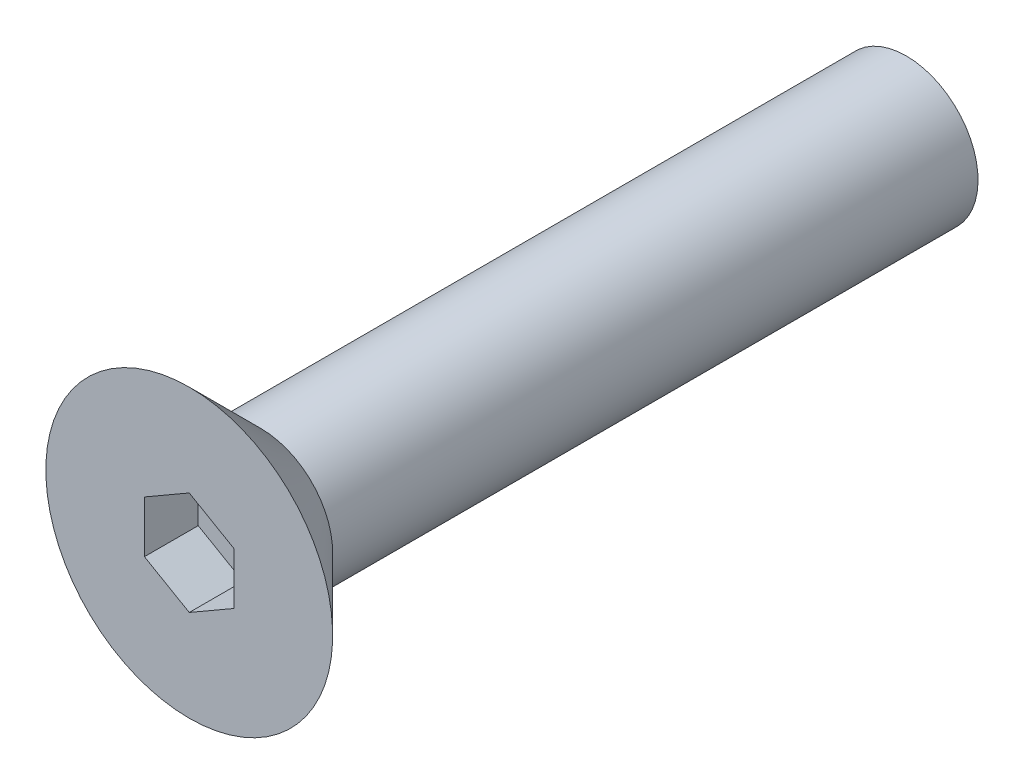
ISO-10303-21;
HEADER;
FILE_DESCRIPTION(('STEP AP214'),'2;1');
FILE_NAME('part.step','',(''),(''),'','','');
FILE_SCHEMA(('AUTOMOTIVE_DESIGN { 1 0 10303 214 1 1 1 1 }'));
ENDSEC;
DATA;
#1=APPLICATION_CONTEXT('core data for automotive mechanical design processes');
#2=APPLICATION_PROTOCOL_DEFINITION('international standard','automotive_design',2000,#1);
#3=PRODUCT_CONTEXT('',#1,'mechanical');
#4=PRODUCT('Part','Part','',(#3));
#5=PRODUCT_RELATED_PRODUCT_CATEGORY('part','',(#4));
#6=PRODUCT_DEFINITION_FORMATION('','',#4);
#7=PRODUCT_DEFINITION_CONTEXT('part definition',#1,'design');
#8=PRODUCT_DEFINITION('design','',#6,#7);
#9=PRODUCT_DEFINITION_SHAPE('','',#8);
#10=(LENGTH_UNIT() NAMED_UNIT(*) SI_UNIT(.MILLI.,.METRE.));
#11=(NAMED_UNIT(*) PLANE_ANGLE_UNIT() SI_UNIT($,.RADIAN.));
#12=(NAMED_UNIT(*) SI_UNIT($,.STERADIAN.) SOLID_ANGLE_UNIT());
#13=UNCERTAINTY_MEASURE_WITH_UNIT(LENGTH_MEASURE(1.E-05),#10,'distance_accuracy_value','');
#14=(GEOMETRIC_REPRESENTATION_CONTEXT(3) GLOBAL_UNCERTAINTY_ASSIGNED_CONTEXT((#13)) GLOBAL_UNIT_ASSIGNED_CONTEXT((#10,
#11,#12)) REPRESENTATION_CONTEXT('',''));
#15=CARTESIAN_POINT('',(0.,0.,0.));
#16=DIRECTION('',(0.,0.,1.));
#17=DIRECTION('',(1.,0.,0.));
#18=AXIS2_PLACEMENT_3D('',#15,#16,#17);
#19=CARTESIAN_POINT('',(0.,0.,0.));
#20=DIRECTION('',(0.,0.,-1.));
#21=DIRECTION('',(0.,1.,0.));
#22=AXIS2_PLACEMENT_3D('',#19,#20,#21);
#23=PLANE('',#22);
#24=DIRECTION('',(-0.866025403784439,-0.5,0.));
#25=VECTOR('',#24,1.);
#26=CARTESIAN_POINT('',(0.,2.88675134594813,0.));
#27=LINE('',#26,#25);
#28=CARTESIAN_POINT('',(0.,2.88675134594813,0.));
#29=VERTEX_POINT('',#28);
#30=CARTESIAN_POINT('',(-2.5,1.44337567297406,0.));
#31=VERTEX_POINT('',#30);
#32=EDGE_CURVE('E102',#29,#31,#27,.T.);
#33=ORIENTED_EDGE('',*,*,#32,.F.);
#34=DIRECTION('',(-0.866025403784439,0.5,0.));
#35=VECTOR('',#34,1.);
#36=CARTESIAN_POINT('',(2.5,1.44337567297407,0.));
#37=LINE('',#36,#35);
#38=CARTESIAN_POINT('',(2.5,1.44337567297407,0.));
#39=VERTEX_POINT('',#38);
#40=EDGE_CURVE('E28',#39,#29,#37,.T.);
#41=ORIENTED_EDGE('',*,*,#40,.F.);
#42=DIRECTION('',(0.,1.,0.));
#43=VECTOR('',#42,1.);
#44=CARTESIAN_POINT('',(2.5,-1.44337567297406,0.));
#45=LINE('',#44,#43);
#46=CARTESIAN_POINT('',(2.5,-1.44337567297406,0.));
#47=VERTEX_POINT('',#46);
#48=EDGE_CURVE('E111',#47,#39,#45,.T.);
#49=ORIENTED_EDGE('',*,*,#48,.F.);
#50=DIRECTION('',(0.866025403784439,0.5,0.));
#51=VECTOR('',#50,1.);
#52=CARTESIAN_POINT('',(0.,-2.88675134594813,0.));
#53=LINE('',#52,#51);
#54=CARTESIAN_POINT('',(0.,-2.88675134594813,0.));
#55=VERTEX_POINT('',#54);
#56=EDGE_CURVE('E109',#55,#47,#53,.T.);
#57=ORIENTED_EDGE('',*,*,#56,.F.);
#58=DIRECTION('',(0.866025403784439,-0.5,0.));
#59=VECTOR('',#58,1.);
#60=CARTESIAN_POINT('',(-2.5,-1.44337567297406,0.));
#61=LINE('',#60,#59);
#62=CARTESIAN_POINT('',(-2.5,-1.44337567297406,0.));
#63=VERTEX_POINT('',#62);
#64=EDGE_CURVE('E76',#63,#55,#61,.T.);
#65=ORIENTED_EDGE('',*,*,#64,.F.);
#66=DIRECTION('',(0.,-1.,0.));
#67=VECTOR('',#66,1.);
#68=CARTESIAN_POINT('',(-2.5,1.44337567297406,0.));
#69=LINE('',#68,#67);
#70=EDGE_CURVE('E105',#31,#63,#69,.T.);
#71=ORIENTED_EDGE('',*,*,#70,.F.);
#72=EDGE_LOOP('',(#33,#41,#49,#57,#65,#71));
#73=FACE_BOUND('',#72,.T.);
#74=CARTESIAN_POINT('',(0.,0.,0.));
#75=DIRECTION('',(0.,0.,-1.));
#76=DIRECTION('',(0.,1.,0.));
#77=AXIS2_PLACEMENT_3D('',#74,#75,#76);
#78=CIRCLE('',#77,8.);
#79=CARTESIAN_POINT('',(0.,8.,0.));
#80=VERTEX_POINT('',#79);
#81=EDGE_CURVE('E9',#80,#80,#78,.T.);
#82=ORIENTED_EDGE('',*,*,#81,.F.);
#83=EDGE_LOOP('',(#82));
#84=FACE_BOUND('',#83,.T.);
#85=ADVANCED_FACE('F14',(#73,#84),#23,.F.);
#86=CARTESIAN_POINT('',(0.,0.,0.));
#87=DIRECTION('',(0.,0.,1.));
#88=DIRECTION('',(0.,-1.,0.));
#89=AXIS2_PLACEMENT_3D('',#86,#87,#88);
#90=CONICAL_SURFACE('',#89,8.,0.785398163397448);
#91=CARTESIAN_POINT('',(0.,0.,-4.));
#92=DIRECTION('',(0.,0.,-1.));
#93=DIRECTION('',(0.,1.,0.));
#94=AXIS2_PLACEMENT_3D('',#91,#92,#93);
#95=CIRCLE('',#94,4.);
#96=CARTESIAN_POINT('',(0.,4.,-4.));
#97=VERTEX_POINT('',#96);
#98=EDGE_CURVE('E21',#97,#97,#95,.T.);
#99=ORIENTED_EDGE('',*,*,#98,.F.);
#100=EDGE_LOOP('',(#99));
#101=FACE_BOUND('',#100,.T.);
#102=ORIENTED_EDGE('',*,*,#81,.T.);
#103=EDGE_LOOP('',(#102));
#104=FACE_BOUND('',#103,.T.);
#105=ADVANCED_FACE('F127',(#101,#104),#90,.T.);
#106=CARTESIAN_POINT('',(0.,0.,-10.0277639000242));
#107=DIRECTION('',(0.,0.,-1.));
#108=DIRECTION('',(0.,1.,0.));
#109=AXIS2_PLACEMENT_3D('',#106,#107,#108);
#110=CYLINDRICAL_SURFACE('',#109,4.);
#111=CARTESIAN_POINT('',(0.,0.,-40.));
#112=DIRECTION('',(0.,0.,-1.));
#113=DIRECTION('',(0.,1.,0.));
#114=AXIS2_PLACEMENT_3D('',#111,#112,#113);
#115=CIRCLE('',#114,4.);
#116=CARTESIAN_POINT('',(0.,3.99999999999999,-40.));
#117=VERTEX_POINT('',#116);
#118=EDGE_CURVE('E115',#117,#117,#115,.T.);
#119=ORIENTED_EDGE('',*,*,#118,.F.);
#120=EDGE_LOOP('',(#119));
#121=FACE_BOUND('',#120,.T.);
#122=ORIENTED_EDGE('',*,*,#98,.T.);
#123=EDGE_LOOP('',(#122));
#124=FACE_BOUND('',#123,.T.);
#125=ADVANCED_FACE('F125',(#121,#124),#110,.T.);
#126=CARTESIAN_POINT('',(0.,4.,-40.));
#127=DIRECTION('',(0.,0.,1.));
#128=DIRECTION('',(0.,-1.,0.));
#129=AXIS2_PLACEMENT_3D('',#126,#127,#128);
#130=PLANE('',#129);
#131=ORIENTED_EDGE('',*,*,#118,.T.);
#132=EDGE_LOOP('',(#131));
#133=FACE_BOUND('',#132,.T.);
#134=ADVANCED_FACE('F147',(#133),#130,.F.);
#135=CARTESIAN_POINT('',(2.5,1.44337567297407,-3.));
#136=DIRECTION('',(0.5,0.866025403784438,0.));
#137=DIRECTION('',(-0.866025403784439,0.5,0.));
#138=AXIS2_PLACEMENT_3D('',#135,#136,#137);
#139=PLANE('',#138);
#140=ORIENTED_EDGE('',*,*,#40,.T.);
#141=DIRECTION('',(0.,0.,1.));
#142=VECTOR('',#141,1.);
#143=CARTESIAN_POINT('',(0.,2.88675134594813,-3.));
#144=LINE('',#143,#142);
#145=CARTESIAN_POINT('',(0.,2.88675134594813,-3.));
#146=VERTEX_POINT('',#145);
#147=EDGE_CURVE('E58',#146,#29,#144,.T.);
#148=ORIENTED_EDGE('',*,*,#147,.F.);
#149=DIRECTION('',(-0.866025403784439,0.5,0.));
#150=VECTOR('',#149,1.);
#151=CARTESIAN_POINT('',(2.5,1.44337567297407,-3.));
#152=LINE('',#151,#150);
#153=CARTESIAN_POINT('',(2.5,1.44337567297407,-3.));
#154=VERTEX_POINT('',#153);
#155=EDGE_CURVE('E113',#154,#146,#152,.T.);
#156=ORIENTED_EDGE('',*,*,#155,.F.);
#157=DIRECTION('',(0.,0.,1.));
#158=VECTOR('',#157,1.);
#159=CARTESIAN_POINT('',(2.5,1.44337567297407,-3.));
#160=LINE('',#159,#158);
#161=EDGE_CURVE('E36',#154,#39,#160,.T.);
#162=ORIENTED_EDGE('',*,*,#161,.T.);
#163=EDGE_LOOP('',(#140,#148,#156,#162));
#164=FACE_BOUND('',#163,.T.);
#165=ADVANCED_FACE('F144',(#164),#139,.F.);
#166=CARTESIAN_POINT('',(2.5,-1.44337567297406,-3.));
#167=DIRECTION('',(1.,0.,0.));
#168=DIRECTION('',(0.,0.,-1.));
#169=AXIS2_PLACEMENT_3D('',#166,#167,#168);
#170=PLANE('',#169);
#171=ORIENTED_EDGE('',*,*,#48,.T.);
#172=ORIENTED_EDGE('',*,*,#161,.F.);
#173=DIRECTION('',(0.,1.,0.));
#174=VECTOR('',#173,1.);
#175=CARTESIAN_POINT('',(2.5,-1.44337567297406,-3.));
#176=LINE('',#175,#174);
#177=CARTESIAN_POINT('',(2.5,-1.44337567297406,-3.));
#178=VERTEX_POINT('',#177);
#179=EDGE_CURVE('E88',#178,#154,#176,.T.);
#180=ORIENTED_EDGE('',*,*,#179,.F.);
#181=DIRECTION('',(0.,0.,1.));
#182=VECTOR('',#181,1.);
#183=CARTESIAN_POINT('',(2.5,-1.44337567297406,-3.));
#184=LINE('',#183,#182);
#185=EDGE_CURVE('E80',#178,#47,#184,.T.);
#186=ORIENTED_EDGE('',*,*,#185,.T.);
#187=EDGE_LOOP('',(#171,#172,#180,#186));
#188=FACE_BOUND('',#187,.T.);
#189=ADVANCED_FACE('F146',(#188),#170,.F.);
#190=CARTESIAN_POINT('',(0.,-2.88675134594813,-3.));
#191=DIRECTION('',(0.5,-0.866025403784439,0.));
#192=DIRECTION('',(0.866025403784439,0.5,0.));
#193=AXIS2_PLACEMENT_3D('',#190,#191,#192);
#194=PLANE('',#193);
#195=ORIENTED_EDGE('',*,*,#56,.T.);
#196=ORIENTED_EDGE('',*,*,#185,.F.);
#197=DIRECTION('',(0.866025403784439,0.5,0.));
#198=VECTOR('',#197,1.);
#199=CARTESIAN_POINT('',(0.,-2.88675134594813,-3.));
#200=LINE('',#199,#198);
#201=CARTESIAN_POINT('',(0.,-2.88675134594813,-3.));
#202=VERTEX_POINT('',#201);
#203=EDGE_CURVE('E84',#202,#178,#200,.T.);
#204=ORIENTED_EDGE('',*,*,#203,.F.);
#205=DIRECTION('',(0.,0.,1.));
#206=VECTOR('',#205,1.);
#207=CARTESIAN_POINT('',(0.,-2.88675134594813,-3.));
#208=LINE('',#207,#206);
#209=EDGE_CURVE('E69',#202,#55,#208,.T.);
#210=ORIENTED_EDGE('',*,*,#209,.T.);
#211=EDGE_LOOP('',(#195,#196,#204,#210));
#212=FACE_BOUND('',#211,.T.);
#213=ADVANCED_FACE('F85',(#212),#194,.F.);
#214=CARTESIAN_POINT('',(-2.5,-1.44337567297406,-3.));
#215=DIRECTION('',(-0.5,-0.866025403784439,0.));
#216=DIRECTION('',(0.866025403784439,-0.5,0.));
#217=AXIS2_PLACEMENT_3D('',#214,#215,#216);
#218=PLANE('',#217);
#219=ORIENTED_EDGE('',*,*,#64,.T.);
#220=ORIENTED_EDGE('',*,*,#209,.F.);
#221=DIRECTION('',(0.866025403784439,-0.5,0.));
#222=VECTOR('',#221,1.);
#223=CARTESIAN_POINT('',(-2.5,-1.44337567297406,-3.));
#224=LINE('',#223,#222);
#225=CARTESIAN_POINT('',(-2.5,-1.44337567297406,-3.));
#226=VERTEX_POINT('',#225);
#227=EDGE_CURVE('E73',#226,#202,#224,.T.);
#228=ORIENTED_EDGE('',*,*,#227,.F.);
#229=DIRECTION('',(0.,0.,1.));
#230=VECTOR('',#229,1.);
#231=CARTESIAN_POINT('',(-2.5,-1.44337567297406,-3.));
#232=LINE('',#231,#230);
#233=EDGE_CURVE('E81',#226,#63,#232,.T.);
#234=ORIENTED_EDGE('',*,*,#233,.T.);
#235=EDGE_LOOP('',(#219,#220,#228,#234));
#236=FACE_BOUND('',#235,.T.);
#237=ADVANCED_FACE('F71',(#236),#218,.F.);
#238=CARTESIAN_POINT('',(-2.5,1.44337567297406,-3.));
#239=DIRECTION('',(-1.,0.,0.));
#240=DIRECTION('',(0.,-1.,0.));
#241=AXIS2_PLACEMENT_3D('',#238,#239,#240);
#242=PLANE('',#241);
#243=ORIENTED_EDGE('',*,*,#70,.T.);
#244=ORIENTED_EDGE('',*,*,#233,.F.);
#245=DIRECTION('',(0.,-1.,0.));
#246=VECTOR('',#245,1.);
#247=CARTESIAN_POINT('',(-2.5,1.44337567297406,-3.));
#248=LINE('',#247,#246);
#249=CARTESIAN_POINT('',(-2.5,1.44337567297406,-3.));
#250=VERTEX_POINT('',#249);
#251=EDGE_CURVE('E94',#250,#226,#248,.T.);
#252=ORIENTED_EDGE('',*,*,#251,.F.);
#253=DIRECTION('',(0.,0.,1.));
#254=VECTOR('',#253,1.);
#255=CARTESIAN_POINT('',(-2.5,1.44337567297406,-3.));
#256=LINE('',#255,#254);
#257=EDGE_CURVE('E118',#250,#31,#256,.T.);
#258=ORIENTED_EDGE('',*,*,#257,.T.);
#259=EDGE_LOOP('',(#243,#244,#252,#258));
#260=FACE_BOUND('',#259,.T.);
#261=ADVANCED_FACE('F212',(#260),#242,.F.);
#262=CARTESIAN_POINT('',(0.,2.88675134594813,-3.));
#263=DIRECTION('',(-0.5,0.866025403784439,0.));
#264=DIRECTION('',(-0.866025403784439,-0.5,0.));
#265=AXIS2_PLACEMENT_3D('',#262,#263,#264);
#266=PLANE('',#265);
#267=ORIENTED_EDGE('',*,*,#32,.T.);
#268=ORIENTED_EDGE('',*,*,#257,.F.);
#269=DIRECTION('',(-0.866025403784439,-0.5,0.));
#270=VECTOR('',#269,1.);
#271=CARTESIAN_POINT('',(0.,2.88675134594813,-3.));
#272=LINE('',#271,#270);
#273=EDGE_CURVE('E96',#146,#250,#272,.T.);
#274=ORIENTED_EDGE('',*,*,#273,.F.);
#275=ORIENTED_EDGE('',*,*,#147,.T.);
#276=EDGE_LOOP('',(#267,#268,#274,#275));
#277=FACE_BOUND('',#276,.T.);
#278=ADVANCED_FACE('F142',(#277),#266,.F.);
#279=CARTESIAN_POINT('',(0.,0.,-3.));
#280=DIRECTION('',(0.,0.,1.));
#281=DIRECTION('',(1.,0.,0.));
#282=AXIS2_PLACEMENT_3D('',#279,#280,#281);
#283=PLANE('',#282);
#284=ORIENTED_EDGE('',*,*,#155,.T.);
#285=ORIENTED_EDGE('',*,*,#273,.T.);
#286=ORIENTED_EDGE('',*,*,#251,.T.);
#287=ORIENTED_EDGE('',*,*,#227,.T.);
#288=ORIENTED_EDGE('',*,*,#203,.T.);
#289=ORIENTED_EDGE('',*,*,#179,.T.);
#290=EDGE_LOOP('',(#284,#285,#286,#287,#288,#289));
#291=FACE_BOUND('',#290,.T.);
#292=ADVANCED_FACE('F91',(#291),#283,.T.);
#293=CLOSED_SHELL('',(#85,#105,#125,#134,#165,#189,#213,#237,#261,#278,#292));
#294=MANIFOLD_SOLID_BREP('B1',#293);
#295=ADVANCED_BREP_SHAPE_REPRESENTATION('',(#18,#294),#14);
#296=SHAPE_DEFINITION_REPRESENTATION(#9,#295);
ENDSEC;
END-ISO-10303-21;
